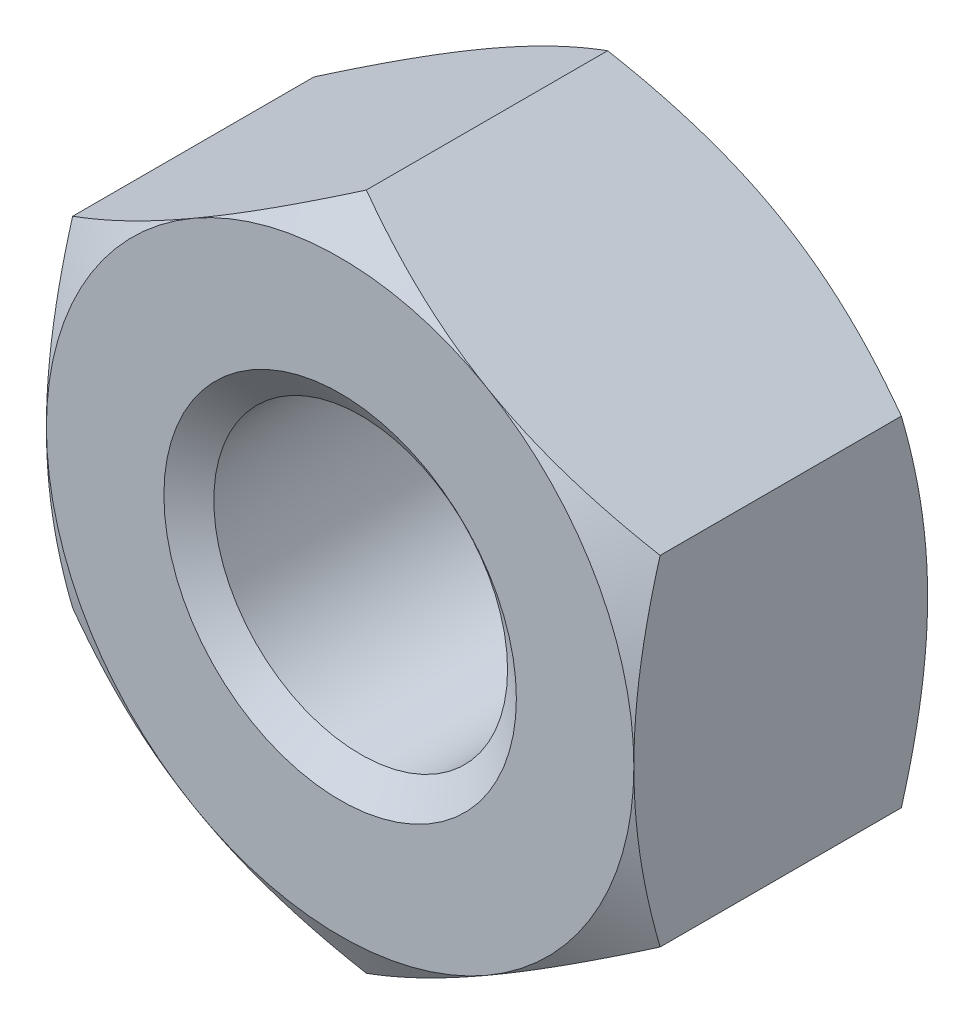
ISO-10303-21;
HEADER;
FILE_DESCRIPTION(('STEP AP214'),'2;1');
FILE_NAME('part.step','',(''),(''),'','','');
FILE_SCHEMA(('AUTOMOTIVE_DESIGN { 1 0 10303 214 1 1 1 1 }'));
ENDSEC;
DATA;
#1=APPLICATION_CONTEXT('core data for automotive mechanical design processes');
#2=APPLICATION_PROTOCOL_DEFINITION('international standard','automotive_design',2000,#1);
#3=PRODUCT_CONTEXT('',#1,'mechanical');
#4=PRODUCT('Part','Part','',(#3));
#5=PRODUCT_RELATED_PRODUCT_CATEGORY('part','',(#4));
#6=PRODUCT_DEFINITION_FORMATION('','',#4);
#7=PRODUCT_DEFINITION_CONTEXT('part definition',#1,'design');
#8=PRODUCT_DEFINITION('design','',#6,#7);
#9=PRODUCT_DEFINITION_SHAPE('','',#8);
#10=(LENGTH_UNIT() NAMED_UNIT(*) SI_UNIT(.MILLI.,.METRE.));
#11=(NAMED_UNIT(*) PLANE_ANGLE_UNIT() SI_UNIT($,.RADIAN.));
#12=(NAMED_UNIT(*) SI_UNIT($,.STERADIAN.) SOLID_ANGLE_UNIT());
#13=UNCERTAINTY_MEASURE_WITH_UNIT(LENGTH_MEASURE(1.E-05),#10,'distance_accuracy_value','');
#14=(GEOMETRIC_REPRESENTATION_CONTEXT(3) GLOBAL_UNCERTAINTY_ASSIGNED_CONTEXT((#13)) GLOBAL_UNIT_ASSIGNED_CONTEXT((#10,
#11,#12)) REPRESENTATION_CONTEXT('',''));
#15=CARTESIAN_POINT('',(0.,0.,0.));
#16=DIRECTION('',(0.,0.,1.));
#17=DIRECTION('',(1.,0.,0.));
#18=AXIS2_PLACEMENT_3D('',#15,#16,#17);
#19=CARTESIAN_POINT('',(0.,0.,-5.));
#20=DIRECTION('',(0.,0.,1.));
#21=DIRECTION('',(1.,0.,0.));
#22=AXIS2_PLACEMENT_3D('',#19,#20,#21);
#23=CYLINDRICAL_SURFACE('',#22,2.5);
#24=CARTESIAN_POINT('',(0.,0.,-0.350103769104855));
#25=DIRECTION('',(0.,0.,1.));
#26=DIRECTION('',(1.,0.,0.));
#27=AXIS2_PLACEMENT_3D('',#24,#25,#26);
#28=CIRCLE('',#27,2.5);
#29=CARTESIAN_POINT('',(2.5,0.,-0.350103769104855));
#30=VERTEX_POINT('',#29);
#31=EDGE_CURVE('E171',#30,#30,#28,.F.);
#32=ORIENTED_EDGE('',*,*,#31,.F.);
#33=EDGE_LOOP('',(#32));
#34=FACE_BOUND('',#33,.T.);
#35=CARTESIAN_POINT('',(0.,0.,-4.62449623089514));
#36=DIRECTION('',(0.,0.,-1.));
#37=DIRECTION('',(-1.,0.,0.));
#38=AXIS2_PLACEMENT_3D('',#35,#36,#37);
#39=CIRCLE('',#38,2.5);
#40=CARTESIAN_POINT('',(-2.5,0.,-4.62449623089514));
#41=VERTEX_POINT('',#40);
#42=EDGE_CURVE('E36',#41,#41,#39,.F.);
#43=ORIENTED_EDGE('',*,*,#42,.F.);
#44=EDGE_LOOP('',(#43));
#45=FACE_BOUND('',#44,.T.);
#46=ADVANCED_FACE('F31',(#34,#45),#23,.F.);
#47=CARTESIAN_POINT('',(0.,5.77350269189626,-5.));
#48=DIRECTION('',(0.,0.,-1.));
#49=DIRECTION('',(-1.,0.,0.));
#50=AXIS2_PLACEMENT_3D('',#47,#48,#49);
#51=PLANE('',#50);
#52=CARTESIAN_POINT('',(0.,0.,-5.));
#53=DIRECTION('',(0.,0.,-1.));
#54=DIRECTION('',(-1.,0.,0.));
#55=AXIS2_PLACEMENT_3D('',#52,#53,#54);
#56=CIRCLE('',#55,5.);
#57=CARTESIAN_POINT('',(-5.,0.,-5.));
#58=VERTEX_POINT('',#57);
#59=CARTESIAN_POINT('',(-2.5,-4.33012701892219,-5.));
#60=VERTEX_POINT('',#59);
#61=EDGE_CURVE('E167',#58,#60,#56,.F.);
#62=ORIENTED_EDGE('',*,*,#61,.F.);
#63=CARTESIAN_POINT('',(-2.50000000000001,4.33012701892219,-5.));
#64=VERTEX_POINT('',#63);
#65=EDGE_CURVE('E149',#64,#58,#56,.F.);
#66=ORIENTED_EDGE('',*,*,#65,.F.);
#67=CARTESIAN_POINT('',(2.5,4.33012701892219,-5.));
#68=VERTEX_POINT('',#67);
#69=EDGE_CURVE('E166',#68,#64,#56,.F.);
#70=ORIENTED_EDGE('',*,*,#69,.F.);
#71=CARTESIAN_POINT('',(0.,0.,-5.));
#72=DIRECTION('',(0.,0.,1.));
#73=DIRECTION('',(1.,0.,0.));
#74=AXIS2_PLACEMENT_3D('',#71,#72,#73);
#75=CIRCLE('',#74,5.);
#76=CARTESIAN_POINT('',(5.,0.,-5.));
#77=VERTEX_POINT('',#76);
#78=EDGE_CURVE('E241',#77,#68,#75,.T.);
#79=ORIENTED_EDGE('',*,*,#78,.F.);
#80=CARTESIAN_POINT('',(2.50000000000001,-4.33012701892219,-5.));
#81=VERTEX_POINT('',#80);
#82=EDGE_CURVE('E357',#81,#77,#56,.F.);
#83=ORIENTED_EDGE('',*,*,#82,.F.);
#84=EDGE_CURVE('E361',#60,#81,#56,.F.);
#85=ORIENTED_EDGE('',*,*,#84,.F.);
#86=EDGE_LOOP('',(#62,#66,#70,#79,#83,#85));
#87=FACE_BOUND('',#86,.T.);
#88=CARTESIAN_POINT('',(0.,0.,-5.));
#89=DIRECTION('',(0.,0.,-1.));
#90=DIRECTION('',(-1.,0.,0.));
#91=AXIS2_PLACEMENT_3D('',#88,#89,#90);
#92=CIRCLE('',#91,3.);
#93=CARTESIAN_POINT('',(-3.,0.,-5.));
#94=VERTEX_POINT('',#93);
#95=EDGE_CURVE('E174',#94,#94,#92,.F.);
#96=ORIENTED_EDGE('',*,*,#95,.T.);
#97=EDGE_LOOP('',(#96));
#98=FACE_BOUND('',#97,.T.);
#99=ADVANCED_FACE('F294',(#87,#98),#51,.T.);
#100=CARTESIAN_POINT('',(0.,5.77350269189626,0.));
#101=DIRECTION('',(0.,0.,-1.));
#102=DIRECTION('',(-1.,0.,0.));
#103=AXIS2_PLACEMENT_3D('',#100,#101,#102);
#104=PLANE('',#103);
#105=CARTESIAN_POINT('',(0.,0.,0.));
#106=DIRECTION('',(0.,0.,-1.));
#107=DIRECTION('',(-1.,0.,0.));
#108=AXIS2_PLACEMENT_3D('',#105,#106,#107);
#109=CIRCLE('',#108,5.);
#110=CARTESIAN_POINT('',(-5.,0.,0.));
#111=VERTEX_POINT('',#110);
#112=CARTESIAN_POINT('',(-2.50000000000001,4.33012701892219,0.));
#113=VERTEX_POINT('',#112);
#114=EDGE_CURVE('E11',#111,#113,#109,.T.);
#115=ORIENTED_EDGE('',*,*,#114,.F.);
#116=CARTESIAN_POINT('',(-2.5,-4.33012701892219,0.));
#117=VERTEX_POINT('',#116);
#118=EDGE_CURVE('E43',#117,#111,#109,.T.);
#119=ORIENTED_EDGE('',*,*,#118,.F.);
#120=CARTESIAN_POINT('',(2.50000000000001,-4.33012701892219,0.));
#121=VERTEX_POINT('',#120);
#122=EDGE_CURVE('E170',#121,#117,#109,.T.);
#123=ORIENTED_EDGE('',*,*,#122,.F.);
#124=CARTESIAN_POINT('',(5.,0.,0.));
#125=VERTEX_POINT('',#124);
#126=EDGE_CURVE('E348',#125,#121,#109,.T.);
#127=ORIENTED_EDGE('',*,*,#126,.F.);
#128=CARTESIAN_POINT('',(0.,0.,0.));
#129=DIRECTION('',(0.,0.,1.));
#130=DIRECTION('',(1.,0.,0.));
#131=AXIS2_PLACEMENT_3D('',#128,#129,#130);
#132=CIRCLE('',#131,5.);
#133=CARTESIAN_POINT('',(2.5,4.33012701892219,0.));
#134=VERTEX_POINT('',#133);
#135=EDGE_CURVE('E125',#125,#134,#132,.T.);
#136=ORIENTED_EDGE('',*,*,#135,.T.);
#137=EDGE_CURVE('E41',#113,#134,#109,.T.);
#138=ORIENTED_EDGE('',*,*,#137,.F.);
#139=EDGE_LOOP('',(#115,#119,#123,#127,#136,#138));
#140=FACE_BOUND('',#139,.T.);
#141=CARTESIAN_POINT('',(0.,0.,0.));
#142=DIRECTION('',(0.,0.,1.));
#143=DIRECTION('',(1.,0.,0.));
#144=AXIS2_PLACEMENT_3D('',#141,#142,#143);
#145=CIRCLE('',#144,3.);
#146=CARTESIAN_POINT('',(3.,0.,0.));
#147=VERTEX_POINT('',#146);
#148=EDGE_CURVE('E173',#147,#147,#145,.T.);
#149=ORIENTED_EDGE('',*,*,#148,.F.);
#150=EDGE_LOOP('',(#149));
#151=FACE_BOUND('',#150,.T.);
#152=ADVANCED_FACE('F246',(#140,#151),#104,.F.);
#153=CARTESIAN_POINT('',(0.,5.77350269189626,-5.));
#154=DIRECTION('',(-0.500000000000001,0.866025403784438,0.));
#155=DIRECTION('',(-0.866025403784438,-0.500000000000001,0.));
#156=AXIS2_PLACEMENT_3D('',#153,#154,#155);
#157=PLANE('',#156);
#158=DIRECTION('',(0.,0.,1.));
#159=VECTOR('',#158,1.);
#160=CARTESIAN_POINT('',(-5.,2.88675134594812,-5.));
#161=LINE('',#160,#159);
#162=CARTESIAN_POINT('',(-5.,2.88675134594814,-4.55341801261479));
#163=VERTEX_POINT('',#162);
#164=CARTESIAN_POINT('',(-5.,2.88675134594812,-0.446581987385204));
#165=VERTEX_POINT('',#164);
#166=EDGE_CURVE('E161',#163,#165,#161,.T.);
#167=ORIENTED_EDGE('',*,*,#166,.T.);
#168=CARTESIAN_POINT('',(-5.0002,2.88663587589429,-0.44664865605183));
#169=CARTESIAN_POINT('',(-4.78046540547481,3.01349970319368,-0.373386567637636));
#170=CARTESIAN_POINT('',(-4.55885141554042,3.14144859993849,-0.306751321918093));
#171=CARTESIAN_POINT('',(-4.11178600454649,3.39956193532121,-0.190438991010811));
#172=CARTESIAN_POINT('',(-3.88632664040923,3.52973095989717,-0.140803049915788));
#173=CARTESIAN_POINT('',(-3.43816769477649,3.78847564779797,-0.0635510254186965));
#174=CARTESIAN_POINT('',(-3.21553790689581,3.91701101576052,-0.0354203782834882));
#175=CARTESIAN_POINT('',(-2.88081009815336,4.11026620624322,-0.0101949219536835));
#176=CARTESIAN_POINT('',(-2.76915780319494,4.17472868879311,-0.00461345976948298));
#177=CARTESIAN_POINT('',(-2.5457500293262,4.30371322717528,0.000797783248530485));
#178=CARTESIAN_POINT('',(-2.43399455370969,4.36823528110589,0.000627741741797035));
#179=CARTESIAN_POINT('',(-2.12781576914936,4.54500768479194,-0.00775363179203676));
#180=CARTESIAN_POINT('',(-1.93349391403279,4.65719946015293,-0.021829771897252));
#181=CARTESIAN_POINT('',(-1.54613989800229,4.88083840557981,-0.0664652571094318));
#182=CARTESIAN_POINT('',(-1.35310909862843,4.99228478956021,-0.0970398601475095));
#183=CARTESIAN_POINT('',(-0.964974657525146,5.21637431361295,-0.173468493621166));
#184=CARTESIAN_POINT('',(-0.769920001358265,5.32898917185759,-0.219646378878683));
#185=CARTESIAN_POINT('',(-0.382719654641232,5.55253939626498,-0.324451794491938));
#186=CARTESIAN_POINT('',(-0.190569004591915,5.66347762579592,-0.383054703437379));
#187=CARTESIAN_POINT('',(0.000199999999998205,5.7736181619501,-0.446648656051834));
#188=B_SPLINE_CURVE_WITH_KNOTS('',3,(#168,#169,#170,#171,#172,#173,#174,#175,#176,#177,#178,
#179,#180,#181,#182,#183,#184,#185,#186,#187),.UNSPECIFIED.,.F.,.F.,(4,2,2,2,2,2,2,2,2,4),(0.,
0.792555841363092,1.58701660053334,2.36181537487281,2.74884076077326,3.13585419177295,
3.8096236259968,4.4840172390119,5.17336882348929,5.86136694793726),.UNSPECIFIED.);
#189=EDGE_CURVE('E130',#165,#113,#188,.T.);
#190=ORIENTED_EDGE('',*,*,#189,.T.);
#191=CARTESIAN_POINT('',(0.,5.77350269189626,-0.446581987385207));
#192=VERTEX_POINT('',#191);
#193=EDGE_CURVE('E50',#113,#192,#188,.T.);
#194=ORIENTED_EDGE('',*,*,#193,.T.);
#195=DIRECTION('',(0.,0.,1.));
#196=VECTOR('',#195,1.);
#197=CARTESIAN_POINT('',(0.,5.77350269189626,-5.));
#198=LINE('',#197,#196);
#199=CARTESIAN_POINT('',(0.,5.77350269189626,-4.55341801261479));
#200=VERTEX_POINT('',#199);
#201=EDGE_CURVE('E146',#200,#192,#198,.T.);
#202=ORIENTED_EDGE('',*,*,#201,.F.);
#203=CARTESIAN_POINT('',(-5.0002,2.88663587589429,-4.55335134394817));
#204=CARTESIAN_POINT('',(-4.78046540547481,3.01349970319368,-4.62661343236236));
#205=CARTESIAN_POINT('',(-4.55885141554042,3.14144859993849,-4.69324867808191));
#206=CARTESIAN_POINT('',(-4.11178600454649,3.39956193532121,-4.80956100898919));
#207=CARTESIAN_POINT('',(-3.88632664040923,3.52973095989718,-4.85919695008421));
#208=CARTESIAN_POINT('',(-3.43816769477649,3.78847564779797,-4.9364489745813));
#209=CARTESIAN_POINT('',(-3.21553790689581,3.91701101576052,-4.96457962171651));
#210=CARTESIAN_POINT('',(-2.88081009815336,4.11026620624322,-4.98980507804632));
#211=CARTESIAN_POINT('',(-2.76915780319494,4.17472868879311,-4.99538654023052));
#212=CARTESIAN_POINT('',(-2.5457500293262,4.30371322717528,-5.00079778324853));
#213=CARTESIAN_POINT('',(-2.43399455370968,4.36823528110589,-5.0006277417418));
#214=CARTESIAN_POINT('',(-2.12781576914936,4.54500768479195,-4.99224636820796));
#215=CARTESIAN_POINT('',(-1.93349391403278,4.65719946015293,-4.97817022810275));
#216=CARTESIAN_POINT('',(-1.54613989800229,4.88083840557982,-4.93353474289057));
#217=CARTESIAN_POINT('',(-1.35310909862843,4.99228478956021,-4.90296013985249));
#218=CARTESIAN_POINT('',(-0.964974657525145,5.21637431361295,-4.82653150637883));
#219=CARTESIAN_POINT('',(-0.769920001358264,5.32898917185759,-4.78035362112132));
#220=CARTESIAN_POINT('',(-0.382719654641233,5.55253939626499,-4.67554820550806));
#221=CARTESIAN_POINT('',(-0.190569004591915,5.66347762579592,-4.61694529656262));
#222=CARTESIAN_POINT('',(0.000199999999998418,5.7736181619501,-4.55335134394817));
#223=B_SPLINE_CURVE_WITH_KNOTS('',3,(#203,#204,#205,#206,#207,#208,#209,#210,#211,#212,#213,
#214,#215,#216,#217,#218,#219,#220,#221,#222),.UNSPECIFIED.,.F.,.F.,(4,2,2,2,2,2,2,2,2,4),(0.,
0.792555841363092,1.58701660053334,2.36181537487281,2.74884076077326,3.13585419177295,
3.8096236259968,4.4840172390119,5.17336882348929,5.86136694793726),.UNSPECIFIED.);
#224=EDGE_CURVE('E164',#64,#200,#223,.T.);
#225=ORIENTED_EDGE('',*,*,#224,.F.);
#226=EDGE_CURVE('E256',#163,#64,#223,.T.);
#227=ORIENTED_EDGE('',*,*,#226,.F.);
#228=EDGE_LOOP('',(#167,#190,#194,#202,#225,#227));
#229=FACE_BOUND('',#228,.T.);
#230=ADVANCED_FACE('F33',(#229),#157,.T.);
#231=CARTESIAN_POINT('',(5.,2.88675134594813,-5.));
#232=DIRECTION('',(0.5,0.866025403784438,0.));
#233=DIRECTION('',(-0.866025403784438,0.5,0.));
#234=AXIS2_PLACEMENT_3D('',#231,#232,#233);
#235=PLANE('',#234);
#236=ORIENTED_EDGE('',*,*,#201,.T.);
#237=CARTESIAN_POINT('',(-0.000200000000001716,5.7736181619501,-0.446648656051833));
#238=CARTESIAN_POINT('',(0.219534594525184,5.64675433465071,-0.373386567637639));
#239=CARTESIAN_POINT('',(0.441148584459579,5.5188054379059,-0.306751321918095));
#240=CARTESIAN_POINT('',(0.888213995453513,5.26069210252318,-0.190438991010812));
#241=CARTESIAN_POINT('',(1.11367335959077,5.13052307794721,-0.14080304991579));
#242=CARTESIAN_POINT('',(1.56183230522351,4.87177839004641,-0.0635510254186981));
#243=CARTESIAN_POINT('',(1.78446209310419,4.74324302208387,-0.0354203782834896));
#244=CARTESIAN_POINT('',(2.11918990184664,4.54998783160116,-0.0101949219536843));
#245=CARTESIAN_POINT('',(2.23084219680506,4.48552534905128,-0.00461345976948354));
#246=CARTESIAN_POINT('',(2.4542499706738,4.35654081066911,0.000797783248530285));
#247=CARTESIAN_POINT('',(2.56600544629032,4.2920187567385,0.000627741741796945));
#248=CARTESIAN_POINT('',(2.87218423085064,4.11524635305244,-0.0077536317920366));
#249=CARTESIAN_POINT('',(3.06650608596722,4.00305457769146,-0.0218297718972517));
#250=CARTESIAN_POINT('',(3.45386010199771,3.77941563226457,-0.0664652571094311));
#251=CARTESIAN_POINT('',(3.64689090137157,3.66796924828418,-0.0970398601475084));
#252=CARTESIAN_POINT('',(4.03502534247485,3.44387972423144,-0.173468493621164));
#253=CARTESIAN_POINT('',(4.23007999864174,3.3312648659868,-0.219646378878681));
#254=CARTESIAN_POINT('',(4.61728034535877,3.1077146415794,-0.324451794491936));
#255=CARTESIAN_POINT('',(4.80943099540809,2.99677641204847,-0.383054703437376));
#256=CARTESIAN_POINT('',(5.0002,2.88663587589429,-0.446648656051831));
#257=B_SPLINE_CURVE_WITH_KNOTS('',3,(#237,#238,#239,#240,#241,#242,#243,#244,#245,#246,#247,
#248,#249,#250,#251,#252,#253,#254,#255,#256),.UNSPECIFIED.,.F.,.F.,(4,2,2,2,2,2,2,2,2,4),(0.,
0.792555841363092,1.58701660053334,2.36181537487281,2.74884076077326,3.13585419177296,
3.8096236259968,4.4840172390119,5.17336882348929,5.86136694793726),.UNSPECIFIED.);
#258=EDGE_CURVE('E140',#192,#134,#257,.T.);
#259=ORIENTED_EDGE('',*,*,#258,.T.);
#260=CARTESIAN_POINT('',(5.,2.88675134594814,-0.446581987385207));
#261=VERTEX_POINT('',#260);
#262=EDGE_CURVE('E57',#134,#261,#257,.T.);
#263=ORIENTED_EDGE('',*,*,#262,.T.);
#264=DIRECTION('',(0.,0.,1.));
#265=VECTOR('',#264,1.);
#266=CARTESIAN_POINT('',(5.,2.88675134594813,-5.));
#267=LINE('',#266,#265);
#268=CARTESIAN_POINT('',(5.,2.88675134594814,-4.55341801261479));
#269=VERTEX_POINT('',#268);
#270=EDGE_CURVE('E139',#269,#261,#267,.T.);
#271=ORIENTED_EDGE('',*,*,#270,.F.);
#272=CARTESIAN_POINT('',(-0.000200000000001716,5.7736181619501,-4.55335134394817));
#273=CARTESIAN_POINT('',(0.219534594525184,5.64675433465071,-4.62661343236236));
#274=CARTESIAN_POINT('',(0.44114858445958,5.5188054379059,-4.6932486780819));
#275=CARTESIAN_POINT('',(0.888213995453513,5.26069210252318,-4.80956100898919));
#276=CARTESIAN_POINT('',(1.11367335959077,5.13052307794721,-4.85919695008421));
#277=CARTESIAN_POINT('',(1.56183230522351,4.87177839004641,-4.9364489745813));
#278=CARTESIAN_POINT('',(1.78446209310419,4.74324302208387,-4.96457962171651));
#279=CARTESIAN_POINT('',(2.11918990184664,4.54998783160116,-4.98980507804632));
#280=CARTESIAN_POINT('',(2.23084219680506,4.48552534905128,-4.99538654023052));
#281=CARTESIAN_POINT('',(2.4542499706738,4.35654081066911,-5.00079778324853));
#282=CARTESIAN_POINT('',(2.56600544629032,4.2920187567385,-5.0006277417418));
#283=CARTESIAN_POINT('',(2.87218423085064,4.11524635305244,-4.99224636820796));
#284=CARTESIAN_POINT('',(3.06650608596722,4.00305457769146,-4.97817022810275));
#285=CARTESIAN_POINT('',(3.45386010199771,3.77941563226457,-4.93353474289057));
#286=CARTESIAN_POINT('',(3.64689090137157,3.66796924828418,-4.90296013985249));
#287=CARTESIAN_POINT('',(4.03502534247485,3.44387972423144,-4.82653150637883));
#288=CARTESIAN_POINT('',(4.23007999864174,3.3312648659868,-4.78035362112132));
#289=CARTESIAN_POINT('',(4.61728034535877,3.1077146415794,-4.67554820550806));
#290=CARTESIAN_POINT('',(4.80943099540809,2.99677641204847,-4.61694529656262));
#291=CARTESIAN_POINT('',(5.0002,2.88663587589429,-4.55335134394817));
#292=B_SPLINE_CURVE_WITH_KNOTS('',3,(#272,#273,#274,#275,#276,#277,#278,#279,#280,#281,#282,
#283,#284,#285,#286,#287,#288,#289,#290,#291),.UNSPECIFIED.,.F.,.F.,(4,2,2,2,2,2,2,2,2,4),(0.,
0.792555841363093,1.58701660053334,2.36181537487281,2.74884076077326,3.13585419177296,
3.8096236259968,4.4840172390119,5.17336882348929,5.86136694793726),.UNSPECIFIED.);
#293=EDGE_CURVE('E250',#68,#269,#292,.T.);
#294=ORIENTED_EDGE('',*,*,#293,.F.);
#295=EDGE_CURVE('E255',#200,#68,#292,.T.);
#296=ORIENTED_EDGE('',*,*,#295,.F.);
#297=EDGE_LOOP('',(#236,#259,#263,#271,#294,#296));
#298=FACE_BOUND('',#297,.T.);
#299=ADVANCED_FACE('F137',(#298),#235,.T.);
#300=CARTESIAN_POINT('',(5.,2.88675134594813,-5.));
#301=DIRECTION('',(-1.,0.,0.));
#302=DIRECTION('',(0.,0.,1.));
#303=AXIS2_PLACEMENT_3D('',#300,#301,#302);
#304=PLANE('',#303);
#305=CARTESIAN_POINT('',(5.,-7.65608998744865,-2.3926335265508));
#306=CARTESIAN_POINT('',(5.,-7.43656171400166,-2.28654533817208));
#307=CARTESIAN_POINT('',(5.,-7.21651440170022,-2.18151175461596));
#308=CARTESIAN_POINT('',(5.,-6.77510105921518,-1.97415643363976));
#309=CARTESIAN_POINT('',(5.,-6.55373480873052,-1.87183516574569));
#310=CARTESIAN_POINT('',(5.,-6.10820714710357,-1.66996807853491));
#311=CARTESIAN_POINT('',(5.,-5.88403698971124,-1.57044149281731));
#312=CARTESIAN_POINT('',(5.,-5.43385418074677,-1.37566323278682));
#313=CARTESIAN_POINT('',(5.,-5.20784162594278,-1.28041133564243));
#314=CARTESIAN_POINT('',(5.,-4.75080884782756,-1.09418830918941));
#315=CARTESIAN_POINT('',(5.,-4.51976121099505,-1.0032840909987));
#316=CARTESIAN_POINT('',(5.,-4.05494053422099,-0.82859530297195));
#317=CARTESIAN_POINT('',(5.,-3.82116719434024,-0.744811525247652));
#318=CARTESIAN_POINT('',(5.,-3.35100416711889,-0.586614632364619));
#319=CARTESIAN_POINT('',(5.,-3.11462125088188,-0.512181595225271));
#320=CARTESIAN_POINT('',(5.,-2.63849247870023,-0.375104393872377));
#321=CARTESIAN_POINT('',(5.,-2.3987477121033,-0.312456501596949));
#322=CARTESIAN_POINT('',(5.,-1.91574303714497,-0.201987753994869));
#323=CARTESIAN_POINT('',(5.,-1.672482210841,-0.154170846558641));
#324=CARTESIAN_POINT('',(5.,-1.18299359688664,-0.0765955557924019));
#325=CARTESIAN_POINT('',(5.,-0.93676580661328,-0.0468371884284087));
#326=CARTESIAN_POINT('',(5.,-0.567032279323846,-0.0176512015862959));
#327=CARTESIAN_POINT('',(5.,-0.444105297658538,-0.0104963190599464));
#328=CARTESIAN_POINT('',(5.,-0.198053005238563,-0.00139545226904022));
#329=CARTESIAN_POINT('',(5.,-0.0749276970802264,0.000550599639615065));
#330=CARTESIAN_POINT('',(5.,0.171257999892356,-0.000818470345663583));
#331=CARTESIAN_POINT('',(5.,0.294318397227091,-0.00413211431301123));
#332=CARTESIAN_POINT('',(5.,0.540192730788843,-0.0159365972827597));
#333=CARTESIAN_POINT('',(5.,0.663006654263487,-0.0244276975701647));
#334=CARTESIAN_POINT('',(5.,0.96068187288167,-0.0511063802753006));
#335=CARTESIAN_POINT('',(5.,1.1353143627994,-0.0718889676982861));
#336=CARTESIAN_POINT('',(5.,1.48321675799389,-0.122765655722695));
#337=CARTESIAN_POINT('',(5.,1.65648647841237,-0.152860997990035));
#338=CARTESIAN_POINT('',(5.,2.00155426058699,-0.221298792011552));
#339=CARTESIAN_POINT('',(5.,2.17335067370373,-0.259649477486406));
#340=CARTESIAN_POINT('',(5.,2.51518168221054,-0.343428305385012));
#341=CARTESIAN_POINT('',(5.,2.68521638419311,-0.388856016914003));
#342=CARTESIAN_POINT('',(5.,3.02770318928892,-0.486887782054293));
#343=CARTESIAN_POINT('',(5.,3.20011248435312,-0.539640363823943));
#344=CARTESIAN_POINT('',(5.,3.54310870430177,-0.650357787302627));
#345=CARTESIAN_POINT('',(5.,3.71369679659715,-0.708319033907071));
#346=CARTESIAN_POINT('',(5.,4.05236610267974,-0.828256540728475));
#347=CARTESIAN_POINT('',(5.,4.22045602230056,-0.890208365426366));
#348=CARTESIAN_POINT('',(5.,4.55533171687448,-1.01774823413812));
#349=CARTESIAN_POINT('',(5.,4.72211693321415,-1.08333774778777));
#350=CARTESIAN_POINT('',(5.,4.88829623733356,-1.15038625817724));
#351=B_SPLINE_CURVE_WITH_KNOTS('',3,(#305,#306,#307,#308,#309,#310,#311,#312,#313,#314,#315,
#316,#317,#318,#319,#320,#321,#322,#323,#324,#325,#326,#327,#328,#329,#330,#331,#332,#333,#334,
#335,#336,#337,#338,#339,#340,#341,#342,#343,#344,#345,#346,#347,#348,#349,#350),.UNSPECIFIED.,
.F.,.F.,(4,2,2,2,2,2,2,2,2,2,2,2,2,2,2,2,2,2,2,2,2,2,4),(0.,0.731464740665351,1.46305528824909,
2.19883243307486,2.93457117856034,3.67934251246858,4.42419659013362,5.1674358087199,
5.91043951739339,6.65364083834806,7.39684281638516,7.76615414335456,8.13546067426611,
8.50466345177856,8.87388486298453,9.40118542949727,9.92855633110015,10.4564556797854,
10.9843228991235,11.525120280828,12.065547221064,12.6029322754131,13.1405360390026),.UNSPECIFIED.);
#352=CARTESIAN_POINT('',(5.,-2.88675134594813,-0.446581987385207));
#353=VERTEX_POINT('',#352);
#354=EDGE_CURVE('E132',#353,#125,#351,.T.);
#355=ORIENTED_EDGE('',*,*,#354,.F.);
#356=DIRECTION('',(0.,0.,1.));
#357=VECTOR('',#356,1.);
#358=CARTESIAN_POINT('',(5.,-2.88675134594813,-5.));
#359=LINE('',#358,#357);
#360=CARTESIAN_POINT('',(5.,-2.88675134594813,-4.55341801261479));
#361=VERTEX_POINT('',#360);
#362=EDGE_CURVE('E147',#361,#353,#359,.T.);
#363=ORIENTED_EDGE('',*,*,#362,.F.);
#364=CARTESIAN_POINT('',(5.,-7.65608998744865,-2.60736647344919));
#365=CARTESIAN_POINT('',(5.,-7.43656171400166,-2.71345466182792));
#366=CARTESIAN_POINT('',(5.,-7.21651440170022,-2.81848824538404));
#367=CARTESIAN_POINT('',(5.,-6.77510105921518,-3.02584356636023));
#368=CARTESIAN_POINT('',(5.,-6.55373480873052,-3.12816483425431));
#369=CARTESIAN_POINT('',(5.,-6.10820714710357,-3.33003192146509));
#370=CARTESIAN_POINT('',(5.,-5.88403698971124,-3.42955850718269));
#371=CARTESIAN_POINT('',(5.,-5.43385418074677,-3.62433676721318));
#372=CARTESIAN_POINT('',(5.,-5.20784162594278,-3.71958866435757));
#373=CARTESIAN_POINT('',(5.,-4.75080884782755,-3.90581169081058));
#374=CARTESIAN_POINT('',(5.,-4.51976121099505,-3.9967159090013));
#375=CARTESIAN_POINT('',(5.,-4.05494053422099,-4.17140469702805));
#376=CARTESIAN_POINT('',(5.,-3.82116719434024,-4.25518847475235));
#377=CARTESIAN_POINT('',(5.,-3.35100416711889,-4.41338536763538));
#378=CARTESIAN_POINT('',(5.,-3.11462125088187,-4.48781840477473));
#379=CARTESIAN_POINT('',(5.,-2.63849247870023,-4.62489560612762));
#380=CARTESIAN_POINT('',(5.,-2.3987477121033,-4.68754349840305));
#381=CARTESIAN_POINT('',(5.,-1.91574303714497,-4.79801224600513));
#382=CARTESIAN_POINT('',(5.,-1.672482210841,-4.84582915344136));
#383=CARTESIAN_POINT('',(5.,-1.18299359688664,-4.9234044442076));
#384=CARTESIAN_POINT('',(5.,-0.936765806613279,-4.95316281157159));
#385=CARTESIAN_POINT('',(5.,-0.567032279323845,-4.9823487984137));
#386=CARTESIAN_POINT('',(5.,-0.444105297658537,-4.98950368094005));
#387=CARTESIAN_POINT('',(5.,-0.198053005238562,-4.99860454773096));
#388=CARTESIAN_POINT('',(5.,-0.0749276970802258,-5.00055059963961));
#389=CARTESIAN_POINT('',(5.,0.171257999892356,-4.99918152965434));
#390=CARTESIAN_POINT('',(5.,0.294318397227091,-4.99586788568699));
#391=CARTESIAN_POINT('',(5.,0.540192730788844,-4.98406340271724));
#392=CARTESIAN_POINT('',(5.,0.663006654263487,-4.97557230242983));
#393=CARTESIAN_POINT('',(5.,0.960681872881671,-4.9488936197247));
#394=CARTESIAN_POINT('',(5.,1.1353143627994,-4.92811103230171));
#395=CARTESIAN_POINT('',(5.,1.48321675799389,-4.8772343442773));
#396=CARTESIAN_POINT('',(5.,1.65648647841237,-4.84713900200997));
#397=CARTESIAN_POINT('',(5.,2.00155426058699,-4.77870120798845));
#398=CARTESIAN_POINT('',(5.,2.17335067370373,-4.74035052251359));
#399=CARTESIAN_POINT('',(5.,2.51518168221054,-4.65657169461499));
#400=CARTESIAN_POINT('',(5.,2.68521638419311,-4.611143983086));
#401=CARTESIAN_POINT('',(5.,3.02770318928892,-4.51311221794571));
#402=CARTESIAN_POINT('',(5.,3.20011248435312,-4.46035963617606));
#403=CARTESIAN_POINT('',(5.,3.54310870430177,-4.34964221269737));
#404=CARTESIAN_POINT('',(5.,3.71369679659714,-4.29168096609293));
#405=CARTESIAN_POINT('',(5.,4.05236610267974,-4.17174345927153));
#406=CARTESIAN_POINT('',(5.,4.22045602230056,-4.10979163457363));
#407=CARTESIAN_POINT('',(5.,4.55533171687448,-3.98225176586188));
#408=CARTESIAN_POINT('',(5.,4.72211693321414,-3.91666225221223));
#409=CARTESIAN_POINT('',(5.,4.88829623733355,-3.84961374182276));
#410=B_SPLINE_CURVE_WITH_KNOTS('',3,(#364,#365,#366,#367,#368,#369,#370,#371,#372,#373,#374,
#375,#376,#377,#378,#379,#380,#381,#382,#383,#384,#385,#386,#387,#388,#389,#390,#391,#392,#393,
#394,#395,#396,#397,#398,#399,#400,#401,#402,#403,#404,#405,#406,#407,#408,#409),.UNSPECIFIED.,
.F.,.F.,(4,2,2,2,2,2,2,2,2,2,2,2,2,2,2,2,2,2,2,2,2,2,4),(0.,0.731464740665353,1.46305528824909,
2.19883243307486,2.93457117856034,3.67934251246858,4.42419659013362,5.1674358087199,
5.91043951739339,6.65364083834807,7.39684281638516,7.76615414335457,8.13546067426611,
8.50466345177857,8.87388486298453,9.40118542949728,9.92855633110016,10.4564556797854,
10.9843228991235,11.525120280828,12.065547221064,12.6029322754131,13.1405360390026),.UNSPECIFIED.);
#411=EDGE_CURVE('E262',#361,#77,#410,.T.);
#412=ORIENTED_EDGE('',*,*,#411,.T.);
#413=EDGE_CURVE('E145',#77,#269,#410,.T.);
#414=ORIENTED_EDGE('',*,*,#413,.T.);
#415=ORIENTED_EDGE('',*,*,#270,.T.);
#416=EDGE_CURVE('E122',#125,#261,#351,.T.);
#417=ORIENTED_EDGE('',*,*,#416,.F.);
#418=EDGE_LOOP('',(#355,#363,#412,#414,#415,#417));
#419=FACE_BOUND('',#418,.T.);
#420=ADVANCED_FACE('F143',(#419),#304,.F.);
#421=CARTESIAN_POINT('',(0.,-5.77350269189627,-5.));
#422=DIRECTION('',(0.500000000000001,-0.866025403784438,0.));
#423=DIRECTION('',(0.866025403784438,0.500000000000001,0.));
#424=AXIS2_PLACEMENT_3D('',#421,#422,#423);
#425=PLANE('',#424);
#426=ORIENTED_EDGE('',*,*,#362,.T.);
#427=CARTESIAN_POINT('',(5.0002,-2.88663587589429,-0.446648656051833));
#428=CARTESIAN_POINT('',(4.78046540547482,-3.01349970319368,-0.373386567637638));
#429=CARTESIAN_POINT('',(4.55885141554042,-3.1414485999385,-0.306751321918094));
#430=CARTESIAN_POINT('',(4.11178600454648,-3.39956193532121,-0.190438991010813));
#431=CARTESIAN_POINT('',(3.88632664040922,-3.52973095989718,-0.140803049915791));
#432=CARTESIAN_POINT('',(3.43816769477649,-3.78847564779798,-0.0635510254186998));
#433=CARTESIAN_POINT('',(3.21553790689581,-3.91701101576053,-0.0354203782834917));
#434=CARTESIAN_POINT('',(2.88081009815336,-4.11026620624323,-0.0101949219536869));
#435=CARTESIAN_POINT('',(2.76915780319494,-4.17472868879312,-0.00461345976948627));
#436=CARTESIAN_POINT('',(2.5457500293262,-4.30371322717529,0.000797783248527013));
#437=CARTESIAN_POINT('',(2.43399455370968,-4.3682352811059,0.000627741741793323));
#438=CARTESIAN_POINT('',(2.12781576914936,-4.54500768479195,-0.00775363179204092));
#439=CARTESIAN_POINT('',(1.93349391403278,-4.65719946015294,-0.0218297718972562));
#440=CARTESIAN_POINT('',(1.54613989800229,-4.88083840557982,-0.0664652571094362));
#441=CARTESIAN_POINT('',(1.35310909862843,-4.99228478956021,-0.0970398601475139));
#442=CARTESIAN_POINT('',(0.964974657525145,-5.21637431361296,-0.17346849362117));
#443=CARTESIAN_POINT('',(0.769920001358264,-5.3289891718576,-0.219646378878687));
#444=CARTESIAN_POINT('',(0.382719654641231,-5.55253939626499,-0.324451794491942));
#445=CARTESIAN_POINT('',(0.190569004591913,-5.66347762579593,-0.383054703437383));
#446=CARTESIAN_POINT('',(-0.000199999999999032,-5.77361816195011,-0.446648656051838));
#447=B_SPLINE_CURVE_WITH_KNOTS('',3,(#427,#428,#429,#430,#431,#432,#433,#434,#435,#436,#437,
#438,#439,#440,#441,#442,#443,#444,#445,#446),.UNSPECIFIED.,.F.,.F.,(4,2,2,2,2,2,2,2,2,4),(0.,
0.792555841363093,1.58701660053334,2.36181537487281,2.74884076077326,3.13585419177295,
3.8096236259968,4.4840172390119,5.17336882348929,5.86136694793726),.UNSPECIFIED.);
#448=EDGE_CURVE('E343',#353,#121,#447,.T.);
#449=ORIENTED_EDGE('',*,*,#448,.T.);
#450=CARTESIAN_POINT('',(0.,-5.77350269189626,-0.446581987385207));
#451=VERTEX_POINT('',#450);
#452=EDGE_CURVE('E222',#121,#451,#447,.T.);
#453=ORIENTED_EDGE('',*,*,#452,.T.);
#454=DIRECTION('',(0.,0.,1.));
#455=VECTOR('',#454,1.);
#456=CARTESIAN_POINT('',(0.,-5.77350269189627,-5.));
#457=LINE('',#456,#455);
#458=CARTESIAN_POINT('',(0.,-5.77350269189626,-4.55341801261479));
#459=VERTEX_POINT('',#458);
#460=EDGE_CURVE('E152',#459,#451,#457,.T.);
#461=ORIENTED_EDGE('',*,*,#460,.F.);
#462=CARTESIAN_POINT('',(5.0002,-2.88663587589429,-4.55335134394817));
#463=CARTESIAN_POINT('',(4.78046540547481,-3.01349970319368,-4.62661343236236));
#464=CARTESIAN_POINT('',(4.55885141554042,-3.14144859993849,-4.6932486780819));
#465=CARTESIAN_POINT('',(4.11178600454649,-3.39956193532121,-4.80956100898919));
#466=CARTESIAN_POINT('',(3.88632664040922,-3.52973095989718,-4.85919695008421));
#467=CARTESIAN_POINT('',(3.43816769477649,-3.78847564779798,-4.9364489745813));
#468=CARTESIAN_POINT('',(3.2155379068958,-3.91701101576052,-4.96457962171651));
#469=CARTESIAN_POINT('',(2.88081009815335,-4.11026620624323,-4.98980507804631));
#470=CARTESIAN_POINT('',(2.76915780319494,-4.17472868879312,-4.99538654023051));
#471=CARTESIAN_POINT('',(2.5457500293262,-4.30371322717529,-5.00079778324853));
#472=CARTESIAN_POINT('',(2.43399455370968,-4.3682352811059,-5.00062774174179));
#473=CARTESIAN_POINT('',(2.12781576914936,-4.54500768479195,-4.99224636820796));
#474=CARTESIAN_POINT('',(1.93349391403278,-4.65719946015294,-4.97817022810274));
#475=CARTESIAN_POINT('',(1.54613989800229,-4.88083840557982,-4.93353474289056));
#476=CARTESIAN_POINT('',(1.35310909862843,-4.99228478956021,-4.90296013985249));
#477=CARTESIAN_POINT('',(0.964974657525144,-5.21637431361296,-4.82653150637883));
#478=CARTESIAN_POINT('',(0.769920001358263,-5.3289891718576,-4.78035362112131));
#479=CARTESIAN_POINT('',(0.382719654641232,-5.55253939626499,-4.67554820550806));
#480=CARTESIAN_POINT('',(0.190569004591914,-5.66347762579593,-4.61694529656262));
#481=CARTESIAN_POINT('',(-0.000199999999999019,-5.77361816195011,-4.55335134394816));
#482=B_SPLINE_CURVE_WITH_KNOTS('',3,(#462,#463,#464,#465,#466,#467,#468,#469,#470,#471,#472,
#473,#474,#475,#476,#477,#478,#479,#480,#481),.UNSPECIFIED.,.F.,.F.,(4,2,2,2,2,2,2,2,2,4),(0.,
0.792555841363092,1.58701660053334,2.36181537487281,2.74884076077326,3.13585419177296,
3.8096236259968,4.4840172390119,5.17336882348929,5.86136694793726),.UNSPECIFIED.);
#483=EDGE_CURVE('E268',#81,#459,#482,.T.);
#484=ORIENTED_EDGE('',*,*,#483,.F.);
#485=EDGE_CURVE('E267',#361,#81,#482,.T.);
#486=ORIENTED_EDGE('',*,*,#485,.F.);
#487=EDGE_LOOP('',(#426,#449,#453,#461,#484,#486));
#488=FACE_BOUND('',#487,.T.);
#489=ADVANCED_FACE('F278',(#488),#425,.T.);
#490=CARTESIAN_POINT('',(-5.,-2.88675134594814,-5.));
#491=DIRECTION('',(-0.5,-0.866025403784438,0.));
#492=DIRECTION('',(0.866025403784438,-0.5,0.));
#493=AXIS2_PLACEMENT_3D('',#490,#491,#492);
#494=PLANE('',#493);
#495=ORIENTED_EDGE('',*,*,#460,.T.);
#496=CARTESIAN_POINT('',(0.000200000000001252,-5.77361816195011,-0.446648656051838));
#497=CARTESIAN_POINT('',(-0.219534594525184,-5.64675433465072,-0.373386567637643));
#498=CARTESIAN_POINT('',(-0.44114858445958,-5.51880543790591,-0.306751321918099));
#499=CARTESIAN_POINT('',(-0.888213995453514,-5.26069210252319,-0.190438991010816));
#500=CARTESIAN_POINT('',(-1.11367335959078,-5.13052307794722,-0.140803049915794));
#501=CARTESIAN_POINT('',(-1.56183230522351,-4.87177839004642,-0.0635510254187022));
#502=CARTESIAN_POINT('',(-1.7844620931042,-4.74324302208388,-0.0354203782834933));
#503=CARTESIAN_POINT('',(-2.11918990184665,-4.54998783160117,-0.0101949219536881));
#504=CARTESIAN_POINT('',(-2.23084219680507,-4.48552534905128,-0.00461345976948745));
#505=CARTESIAN_POINT('',(-2.4542499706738,-4.35654081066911,0.000797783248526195));
#506=CARTESIAN_POINT('',(-2.56600544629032,-4.2920187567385,0.0006277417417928));
#507=CARTESIAN_POINT('',(-2.87218423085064,-4.11524635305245,-0.00775363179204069));
#508=CARTESIAN_POINT('',(-3.06650608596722,-4.00305457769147,-0.0218297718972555));
#509=CARTESIAN_POINT('',(-3.45386010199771,-3.77941563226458,-0.0664652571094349));
#510=CARTESIAN_POINT('',(-3.64689090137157,-3.66796924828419,-0.0970398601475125));
#511=CARTESIAN_POINT('',(-4.03502534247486,-3.44387972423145,-0.173468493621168));
#512=CARTESIAN_POINT('',(-4.23007999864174,-3.33126486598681,-0.219646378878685));
#513=CARTESIAN_POINT('',(-4.61728034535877,-3.10771464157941,-0.324451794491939));
#514=CARTESIAN_POINT('',(-4.80943099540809,-2.99677641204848,-0.383054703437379));
#515=CARTESIAN_POINT('',(-5.0002,-2.8866358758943,-0.446648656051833));
#516=B_SPLINE_CURVE_WITH_KNOTS('',3,(#496,#497,#498,#499,#500,#501,#502,#503,#504,#505,#506,
#507,#508,#509,#510,#511,#512,#513,#514,#515),.UNSPECIFIED.,.F.,.F.,(4,2,2,2,2,2,2,2,2,4),(0.,
0.792555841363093,1.58701660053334,2.36181537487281,2.74884076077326,3.13585419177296,
3.8096236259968,4.4840172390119,5.17336882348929,5.86136694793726),.UNSPECIFIED.);
#517=EDGE_CURVE('E341',#451,#117,#516,.T.);
#518=ORIENTED_EDGE('',*,*,#517,.T.);
#519=CARTESIAN_POINT('',(-5.,-2.88675134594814,-0.446581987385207));
#520=VERTEX_POINT('',#519);
#521=EDGE_CURVE('E196',#117,#520,#516,.T.);
#522=ORIENTED_EDGE('',*,*,#521,.T.);
#523=DIRECTION('',(0.,0.,1.));
#524=VECTOR('',#523,1.);
#525=CARTESIAN_POINT('',(-5.,-2.88675134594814,-5.));
#526=LINE('',#525,#524);
#527=CARTESIAN_POINT('',(-5.,-2.88675134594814,-4.55341801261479));
#528=VERTEX_POINT('',#527);
#529=EDGE_CURVE('E158',#528,#520,#526,.T.);
#530=ORIENTED_EDGE('',*,*,#529,.F.);
#531=CARTESIAN_POINT('',(0.000200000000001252,-5.77361816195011,-4.55335134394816));
#532=CARTESIAN_POINT('',(-0.219534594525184,-5.64675433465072,-4.62661343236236));
#533=CARTESIAN_POINT('',(-0.44114858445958,-5.51880543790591,-4.6932486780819));
#534=CARTESIAN_POINT('',(-0.888213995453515,-5.26069210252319,-4.80956100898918));
#535=CARTESIAN_POINT('',(-1.11367335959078,-5.13052307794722,-4.85919695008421));
#536=CARTESIAN_POINT('',(-1.56183230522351,-4.87177839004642,-4.9364489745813));
#537=CARTESIAN_POINT('',(-1.7844620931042,-4.74324302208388,-4.96457962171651));
#538=CARTESIAN_POINT('',(-2.11918990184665,-4.54998783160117,-4.98980507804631));
#539=CARTESIAN_POINT('',(-2.23084219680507,-4.48552534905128,-4.99538654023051));
#540=CARTESIAN_POINT('',(-2.4542499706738,-4.35654081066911,-5.00079778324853));
#541=CARTESIAN_POINT('',(-2.56600544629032,-4.2920187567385,-5.00062774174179));
#542=CARTESIAN_POINT('',(-2.87218423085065,-4.11524635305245,-4.99224636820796));
#543=CARTESIAN_POINT('',(-3.06650608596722,-4.00305457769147,-4.97817022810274));
#544=CARTESIAN_POINT('',(-3.45386010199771,-3.77941563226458,-4.93353474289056));
#545=CARTESIAN_POINT('',(-3.64689090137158,-3.66796924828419,-4.90296013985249));
#546=CARTESIAN_POINT('',(-4.03502534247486,-3.44387972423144,-4.82653150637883));
#547=CARTESIAN_POINT('',(-4.23007999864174,-3.33126486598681,-4.78035362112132));
#548=CARTESIAN_POINT('',(-4.61728034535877,-3.10771464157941,-4.67554820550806));
#549=CARTESIAN_POINT('',(-4.80943099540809,-2.99677641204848,-4.61694529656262));
#550=CARTESIAN_POINT('',(-5.0002,-2.8866358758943,-4.55335134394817));
#551=B_SPLINE_CURVE_WITH_KNOTS('',3,(#531,#532,#533,#534,#535,#536,#537,#538,#539,#540,#541,
#542,#543,#544,#545,#546,#547,#548,#549,#550),.UNSPECIFIED.,.F.,.F.,(4,2,2,2,2,2,2,2,2,4),(0.,
0.792555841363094,1.58701660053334,2.36181537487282,2.74884076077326,3.13585419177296,
3.8096236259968,4.4840172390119,5.17336882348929,5.86136694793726),.UNSPECIFIED.);
#552=EDGE_CURVE('E274',#60,#528,#551,.T.);
#553=ORIENTED_EDGE('',*,*,#552,.F.);
#554=EDGE_CURVE('E273',#459,#60,#551,.T.);
#555=ORIENTED_EDGE('',*,*,#554,.F.);
#556=EDGE_LOOP('',(#495,#518,#522,#530,#553,#555));
#557=FACE_BOUND('',#556,.T.);
#558=ADVANCED_FACE('F281',(#557),#494,.T.);
#559=CARTESIAN_POINT('',(-5.,2.88675134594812,-5.));
#560=DIRECTION('',(-1.,0.,0.));
#561=DIRECTION('',(0.,0.,1.));
#562=AXIS2_PLACEMENT_3D('',#559,#560,#561);
#563=PLANE('',#562);
#564=ORIENTED_EDGE('',*,*,#529,.T.);
#565=CARTESIAN_POINT('',(-5.,-7.65608998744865,-2.39263352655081));
#566=CARTESIAN_POINT('',(-5.,-7.43656171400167,-2.28654533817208));
#567=CARTESIAN_POINT('',(-5.,-7.21651440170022,-2.18151175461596));
#568=CARTESIAN_POINT('',(-5.,-6.77510105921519,-1.97415643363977));
#569=CARTESIAN_POINT('',(-5.,-6.55373480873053,-1.87183516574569));
#570=CARTESIAN_POINT('',(-5.,-6.10820714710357,-1.66996807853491));
#571=CARTESIAN_POINT('',(-5.,-5.88403698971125,-1.57044149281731));
#572=CARTESIAN_POINT('',(-5.,-5.43385418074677,-1.37566323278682));
#573=CARTESIAN_POINT('',(-5.,-5.20784162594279,-1.28041133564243));
#574=CARTESIAN_POINT('',(-5.,-4.75080884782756,-1.09418830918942));
#575=CARTESIAN_POINT('',(-5.,-4.51976121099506,-1.0032840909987));
#576=CARTESIAN_POINT('',(-5.,-4.054940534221,-0.828595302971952));
#577=CARTESIAN_POINT('',(-5.,-3.82116719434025,-0.744811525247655));
#578=CARTESIAN_POINT('',(-5.,-3.35100416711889,-0.586614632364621));
#579=CARTESIAN_POINT('',(-5.,-3.11462125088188,-0.512181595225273));
#580=CARTESIAN_POINT('',(-5.,-2.63849247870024,-0.375104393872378));
#581=CARTESIAN_POINT('',(-5.,-2.39874771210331,-0.31245650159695));
#582=CARTESIAN_POINT('',(-5.,-1.91574303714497,-0.201987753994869));
#583=CARTESIAN_POINT('',(-5.,-1.672482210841,-0.154170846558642));
#584=CARTESIAN_POINT('',(-5.,-1.18299359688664,-0.0765955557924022));
#585=CARTESIAN_POINT('',(-5.,-0.936765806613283,-0.0468371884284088));
#586=CARTESIAN_POINT('',(-5.,-0.567032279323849,-0.0176512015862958));
#587=CARTESIAN_POINT('',(-5.,-0.444105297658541,-0.0104963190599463));
#588=CARTESIAN_POINT('',(-5.,-0.198053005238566,-0.00139545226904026));
#589=CARTESIAN_POINT('',(-5.,-0.074927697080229,0.000550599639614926));
#590=CARTESIAN_POINT('',(-5.,0.171257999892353,-0.000818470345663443));
#591=CARTESIAN_POINT('',(-5.,0.294318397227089,-0.0041321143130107));
#592=CARTESIAN_POINT('',(-5.,0.540192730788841,-0.0159365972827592));
#593=CARTESIAN_POINT('',(-5.,0.663006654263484,-0.0244276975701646));
#594=CARTESIAN_POINT('',(-5.,0.960681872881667,-0.0511063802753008));
#595=CARTESIAN_POINT('',(-5.,1.1353143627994,-0.0718889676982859));
#596=CARTESIAN_POINT('',(-5.,1.48321675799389,-0.122765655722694));
#597=CARTESIAN_POINT('',(-5.,1.65648647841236,-0.152860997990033));
#598=CARTESIAN_POINT('',(-5.,2.00155426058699,-0.221298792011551));
#599=CARTESIAN_POINT('',(-5.,2.17335067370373,-0.259649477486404));
#600=CARTESIAN_POINT('',(-5.,2.51518168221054,-0.343428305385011));
#601=CARTESIAN_POINT('',(-5.,2.6852163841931,-0.388856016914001));
#602=CARTESIAN_POINT('',(-5.,3.02770318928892,-0.486887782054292));
#603=CARTESIAN_POINT('',(-5.,3.20011248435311,-0.539640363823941));
#604=CARTESIAN_POINT('',(-5.,3.54310870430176,-0.650357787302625));
#605=CARTESIAN_POINT('',(-5.,3.71369679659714,-0.708319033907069));
#606=CARTESIAN_POINT('',(-5.,4.05236610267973,-0.828256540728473));
#607=CARTESIAN_POINT('',(-5.,4.22045602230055,-0.890208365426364));
#608=CARTESIAN_POINT('',(-5.,4.55533171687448,-1.01774823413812));
#609=CARTESIAN_POINT('',(-5.,4.72211693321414,-1.08333774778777));
#610=CARTESIAN_POINT('',(-5.,4.88829623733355,-1.15038625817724));
#611=B_SPLINE_CURVE_WITH_KNOTS('',3,(#565,#566,#567,#568,#569,#570,#571,#572,#573,#574,#575,
#576,#577,#578,#579,#580,#581,#582,#583,#584,#585,#586,#587,#588,#589,#590,#591,#592,#593,#594,
#595,#596,#597,#598,#599,#600,#601,#602,#603,#604,#605,#606,#607,#608,#609,#610),.UNSPECIFIED.,
.F.,.F.,(4,2,2,2,2,2,2,2,2,2,2,2,2,2,2,2,2,2,2,2,2,2,4),(0.,0.731464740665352,1.46305528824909,
2.19883243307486,2.93457117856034,3.67934251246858,4.42419659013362,5.1674358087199,
5.91043951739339,6.65364083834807,7.39684281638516,7.76615414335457,8.13546067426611,
8.50466345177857,8.87388486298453,9.40118542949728,9.92855633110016,10.4564556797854,
10.9843228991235,11.525120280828,12.065547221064,12.6029322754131,13.1405360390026),.UNSPECIFIED.);
#612=EDGE_CURVE('E195',#520,#111,#611,.T.);
#613=ORIENTED_EDGE('',*,*,#612,.T.);
#614=EDGE_CURVE('E188',#111,#165,#611,.T.);
#615=ORIENTED_EDGE('',*,*,#614,.T.);
#616=ORIENTED_EDGE('',*,*,#166,.F.);
#617=CARTESIAN_POINT('',(-5.,-7.65608998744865,-2.60736647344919));
#618=CARTESIAN_POINT('',(-5.,-7.43656171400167,-2.71345466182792));
#619=CARTESIAN_POINT('',(-5.,-7.21651440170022,-2.81848824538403));
#620=CARTESIAN_POINT('',(-5.,-6.77510105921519,-3.02584356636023));
#621=CARTESIAN_POINT('',(-5.,-6.55373480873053,-3.12816483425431));
#622=CARTESIAN_POINT('',(-5.,-6.10820714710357,-3.33003192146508));
#623=CARTESIAN_POINT('',(-5.,-5.88403698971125,-3.42955850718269));
#624=CARTESIAN_POINT('',(-5.,-5.43385418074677,-3.62433676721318));
#625=CARTESIAN_POINT('',(-5.,-5.20784162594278,-3.71958866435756));
#626=CARTESIAN_POINT('',(-5.,-4.75080884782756,-3.90581169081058));
#627=CARTESIAN_POINT('',(-5.,-4.51976121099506,-3.9967159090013));
#628=CARTESIAN_POINT('',(-5.,-4.054940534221,-4.17140469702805));
#629=CARTESIAN_POINT('',(-5.,-3.82116719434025,-4.25518847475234));
#630=CARTESIAN_POINT('',(-5.,-3.35100416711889,-4.41338536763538));
#631=CARTESIAN_POINT('',(-5.,-3.11462125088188,-4.48781840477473));
#632=CARTESIAN_POINT('',(-5.,-2.63849247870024,-4.62489560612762));
#633=CARTESIAN_POINT('',(-5.,-2.39874771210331,-4.68754349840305));
#634=CARTESIAN_POINT('',(-5.,-1.91574303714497,-4.79801224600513));
#635=CARTESIAN_POINT('',(-5.,-1.672482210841,-4.84582915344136));
#636=CARTESIAN_POINT('',(-5.,-1.18299359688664,-4.9234044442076));
#637=CARTESIAN_POINT('',(-5.,-0.936765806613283,-4.95316281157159));
#638=CARTESIAN_POINT('',(-5.,-0.567032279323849,-4.9823487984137));
#639=CARTESIAN_POINT('',(-5.,-0.444105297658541,-4.98950368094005));
#640=CARTESIAN_POINT('',(-5.,-0.198053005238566,-4.99860454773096));
#641=CARTESIAN_POINT('',(-5.,-0.0749276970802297,-5.00055059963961));
#642=CARTESIAN_POINT('',(-5.,0.171257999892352,-4.99918152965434));
#643=CARTESIAN_POINT('',(-5.,0.294318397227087,-4.99586788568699));
#644=CARTESIAN_POINT('',(-5.,0.54019273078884,-4.98406340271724));
#645=CARTESIAN_POINT('',(-5.,0.663006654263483,-4.97557230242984));
#646=CARTESIAN_POINT('',(-5.,0.960681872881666,-4.9488936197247));
#647=CARTESIAN_POINT('',(-5.,1.1353143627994,-4.92811103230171));
#648=CARTESIAN_POINT('',(-5.,1.48321675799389,-4.87723434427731));
#649=CARTESIAN_POINT('',(-5.,1.65648647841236,-4.84713900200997));
#650=CARTESIAN_POINT('',(-5.,2.00155426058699,-4.77870120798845));
#651=CARTESIAN_POINT('',(-5.,2.17335067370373,-4.7403505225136));
#652=CARTESIAN_POINT('',(-5.,2.51518168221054,-4.65657169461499));
#653=CARTESIAN_POINT('',(-5.,2.6852163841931,-4.611143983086));
#654=CARTESIAN_POINT('',(-5.,3.02770318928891,-4.51311221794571));
#655=CARTESIAN_POINT('',(-5.,3.20011248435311,-4.46035963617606));
#656=CARTESIAN_POINT('',(-5.,3.54310870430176,-4.34964221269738));
#657=CARTESIAN_POINT('',(-5.,3.71369679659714,-4.29168096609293));
#658=CARTESIAN_POINT('',(-5.,4.05236610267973,-4.17174345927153));
#659=CARTESIAN_POINT('',(-5.,4.22045602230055,-4.10979163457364));
#660=CARTESIAN_POINT('',(-5.,4.55533171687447,-3.98225176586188));
#661=CARTESIAN_POINT('',(-5.,4.72211693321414,-3.91666225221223));
#662=CARTESIAN_POINT('',(-5.,4.88829623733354,-3.84961374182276));
#663=B_SPLINE_CURVE_WITH_KNOTS('',3,(#617,#618,#619,#620,#621,#622,#623,#624,#625,#626,#627,
#628,#629,#630,#631,#632,#633,#634,#635,#636,#637,#638,#639,#640,#641,#642,#643,#644,#645,#646,
#647,#648,#649,#650,#651,#652,#653,#654,#655,#656,#657,#658,#659,#660,#661,#662),.UNSPECIFIED.,
.F.,.F.,(4,2,2,2,2,2,2,2,2,2,2,2,2,2,2,2,2,2,2,2,2,2,4),(0.,0.731464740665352,1.46305528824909,
2.19883243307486,2.93457117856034,3.67934251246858,4.42419659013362,5.1674358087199,
5.91043951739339,6.65364083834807,7.39684281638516,7.76615414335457,8.13546067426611,
8.50466345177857,8.87388486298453,9.40118542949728,9.92855633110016,10.4564556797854,
10.9843228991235,11.525120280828,12.065547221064,12.6029322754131,13.1405360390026),.UNSPECIFIED.);
#664=EDGE_CURVE('E377',#58,#163,#663,.T.);
#665=ORIENTED_EDGE('',*,*,#664,.F.);
#666=EDGE_CURVE('E381',#528,#58,#663,.T.);
#667=ORIENTED_EDGE('',*,*,#666,.F.);
#668=EDGE_LOOP('',(#564,#613,#615,#616,#665,#667));
#669=FACE_BOUND('',#668,.T.);
#670=ADVANCED_FACE('F202',(#669),#563,.T.);
#671=CARTESIAN_POINT('',(0.,0.,-5.));
#672=DIRECTION('',(0.,0.,1.));
#673=DIRECTION('',(1.,0.,0.));
#674=AXIS2_PLACEMENT_3D('',#671,#672,#673);
#675=CONICAL_SURFACE('',#674,5.,1.0471975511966);
#676=ORIENTED_EDGE('',*,*,#226,.T.);
#677=ORIENTED_EDGE('',*,*,#65,.T.);
#678=ORIENTED_EDGE('',*,*,#664,.T.);
#679=EDGE_LOOP('',(#676,#677,#678));
#680=FACE_BOUND('',#679,.T.);
#681=ADVANCED_FACE('F291',(#680),#675,.T.);
#682=ORIENTED_EDGE('',*,*,#224,.T.);
#683=ORIENTED_EDGE('',*,*,#295,.T.);
#684=ORIENTED_EDGE('',*,*,#69,.T.);
#685=EDGE_LOOP('',(#682,#683,#684));
#686=FACE_BOUND('',#685,.T.);
#687=ADVANCED_FACE('F369',(#686),#675,.T.);
#688=ORIENTED_EDGE('',*,*,#293,.T.);
#689=ORIENTED_EDGE('',*,*,#413,.F.);
#690=ORIENTED_EDGE('',*,*,#78,.T.);
#691=EDGE_LOOP('',(#688,#689,#690));
#692=FACE_BOUND('',#691,.T.);
#693=ADVANCED_FACE('F380',(#692),#675,.T.);
#694=ORIENTED_EDGE('',*,*,#485,.T.);
#695=ORIENTED_EDGE('',*,*,#82,.T.);
#696=ORIENTED_EDGE('',*,*,#411,.F.);
#697=EDGE_LOOP('',(#694,#695,#696));
#698=FACE_BOUND('',#697,.T.);
#699=ADVANCED_FACE('F355',(#698),#675,.T.);
#700=ORIENTED_EDGE('',*,*,#483,.T.);
#701=ORIENTED_EDGE('',*,*,#554,.T.);
#702=ORIENTED_EDGE('',*,*,#84,.T.);
#703=EDGE_LOOP('',(#700,#701,#702));
#704=FACE_BOUND('',#703,.T.);
#705=ADVANCED_FACE('F362',(#704),#675,.T.);
#706=ORIENTED_EDGE('',*,*,#552,.T.);
#707=ORIENTED_EDGE('',*,*,#666,.T.);
#708=ORIENTED_EDGE('',*,*,#61,.T.);
#709=EDGE_LOOP('',(#706,#707,#708));
#710=FACE_BOUND('',#709,.T.);
#711=ADVANCED_FACE('F210',(#710),#675,.T.);
#712=CARTESIAN_POINT('',(0.,0.,0.));
#713=DIRECTION('',(0.,0.,-1.));
#714=DIRECTION('',(-1.,0.,0.));
#715=AXIS2_PLACEMENT_3D('',#712,#713,#714);
#716=CONICAL_SURFACE('',#715,5.,1.0471975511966);
#717=ORIENTED_EDGE('',*,*,#118,.T.);
#718=ORIENTED_EDGE('',*,*,#612,.F.);
#719=ORIENTED_EDGE('',*,*,#521,.F.);
#720=EDGE_LOOP('',(#717,#718,#719));
#721=FACE_BOUND('',#720,.T.);
#722=ADVANCED_FACE('F204',(#721),#716,.T.);
#723=ORIENTED_EDGE('',*,*,#122,.T.);
#724=ORIENTED_EDGE('',*,*,#517,.F.);
#725=ORIENTED_EDGE('',*,*,#452,.F.);
#726=EDGE_LOOP('',(#723,#724,#725));
#727=FACE_BOUND('',#726,.T.);
#728=ADVANCED_FACE('F209',(#727),#716,.T.);
#729=ORIENTED_EDGE('',*,*,#354,.T.);
#730=ORIENTED_EDGE('',*,*,#126,.T.);
#731=ORIENTED_EDGE('',*,*,#448,.F.);
#732=EDGE_LOOP('',(#729,#730,#731));
#733=FACE_BOUND('',#732,.T.);
#734=ADVANCED_FACE('F320',(#733),#716,.T.);
#735=ORIENTED_EDGE('',*,*,#135,.F.);
#736=ORIENTED_EDGE('',*,*,#416,.T.);
#737=ORIENTED_EDGE('',*,*,#262,.F.);
#738=EDGE_LOOP('',(#735,#736,#737));
#739=FACE_BOUND('',#738,.T.);
#740=ADVANCED_FACE('F123',(#739),#716,.T.);
#741=ORIENTED_EDGE('',*,*,#137,.T.);
#742=ORIENTED_EDGE('',*,*,#258,.F.);
#743=ORIENTED_EDGE('',*,*,#193,.F.);
#744=EDGE_LOOP('',(#741,#742,#743));
#745=FACE_BOUND('',#744,.T.);
#746=ADVANCED_FACE('F212',(#745),#716,.T.);
#747=ORIENTED_EDGE('',*,*,#614,.F.);
#748=ORIENTED_EDGE('',*,*,#114,.T.);
#749=ORIENTED_EDGE('',*,*,#189,.F.);
#750=EDGE_LOOP('',(#747,#748,#749));
#751=FACE_BOUND('',#750,.T.);
#752=ADVANCED_FACE('F314',(#751),#716,.T.);
#753=CARTESIAN_POINT('',(0.,0.,-0.385114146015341));
#754=DIRECTION('',(0.,0.,1.));
#755=DIRECTION('',(1.,0.,0.));
#756=AXIS2_PLACEMENT_3D('',#753,#754,#755);
#757=CONICAL_SURFACE('',#756,2.45,0.95993108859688);
#758=ORIENTED_EDGE('',*,*,#148,.T.);
#759=EDGE_LOOP('',(#758));
#760=FACE_BOUND('',#759,.T.);
#761=ORIENTED_EDGE('',*,*,#31,.T.);
#762=EDGE_LOOP('',(#761));
#763=FACE_BOUND('',#762,.T.);
#764=ADVANCED_FACE('F213',(#760,#763),#757,.F.);
#765=CARTESIAN_POINT('',(0.,0.,-4.9746));
#766=DIRECTION('',(0.,0.,-1.));
#767=DIRECTION('',(-1.,0.,0.));
#768=AXIS2_PLACEMENT_3D('',#765,#766,#767);
#769=CONICAL_SURFACE('',#768,3.,0.95993108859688);
#770=CARTESIAN_POINT('',(0.,0.,-4.9746));
#771=DIRECTION('',(0.,0.,1.));
#772=DIRECTION('',(1.,0.,0.));
#773=AXIS2_PLACEMENT_3D('',#770,#771,#772);
#774=CIRCLE('',#773,3.);
#775=CARTESIAN_POINT('',(3.,0.,-4.9746));
#776=VERTEX_POINT('',#775);
#777=EDGE_CURVE('E176',#776,#776,#774,.T.);
#778=ORIENTED_EDGE('',*,*,#777,.F.);
#779=EDGE_LOOP('',(#778));
#780=FACE_BOUND('',#779,.T.);
#781=ORIENTED_EDGE('',*,*,#42,.T.);
#782=EDGE_LOOP('',(#781));
#783=FACE_BOUND('',#782,.T.);
#784=ADVANCED_FACE('F304',(#780,#783),#769,.F.);
#785=CARTESIAN_POINT('',(0.,0.,-25.0375057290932));
#786=DIRECTION('',(0.,0.,1.));
#787=DIRECTION('',(1.,0.,0.));
#788=AXIS2_PLACEMENT_3D('',#785,#786,#787);
#789=CYLINDRICAL_SURFACE('',#788,3.);
#790=ORIENTED_EDGE('',*,*,#95,.F.);
#791=EDGE_LOOP('',(#790));
#792=FACE_BOUND('',#791,.T.);
#793=ORIENTED_EDGE('',*,*,#777,.T.);
#794=EDGE_LOOP('',(#793));
#795=FACE_BOUND('',#794,.T.);
#796=ADVANCED_FACE('F306',(#792,#795),#789,.F.);
#797=CLOSED_SHELL('',(#46,#99,#152,#230,#299,#420,#489,#558,#670,#681,#687,#693,#699,#705,#711,
#722,#728,#734,#740,#746,#752,#764,#784,#796));
#798=MANIFOLD_SOLID_BREP('B2',#797);
#799=ADVANCED_BREP_SHAPE_REPRESENTATION('',(#18,#798),#14);
#800=SHAPE_DEFINITION_REPRESENTATION(#9,#799);
ENDSEC;
END-ISO-10303-21;
